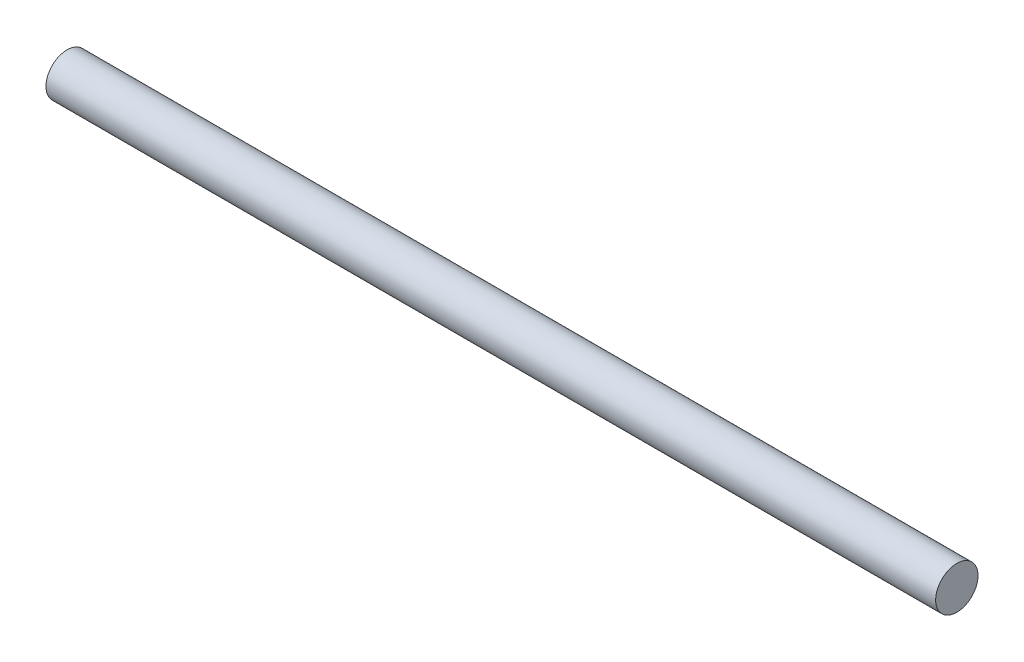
from build123d import *

# Parameters (mm, degrees)
SKETCH1_R           = 9.525
BOSS_EXTRUDE1_DEPTH = 400


with BuildPart() as part:
    # Sketch1 → Boss-Extrude1 (new body)
    with BuildSketch(Plane(origin=(0, 0, 0), x_dir=(0, 0, -1), z_dir=(1, 0, 0))):
        Circle(SKETCH1_R)
    extrude(amount=BOSS_EXTRUDE1_DEPTH)


solid = part.part
